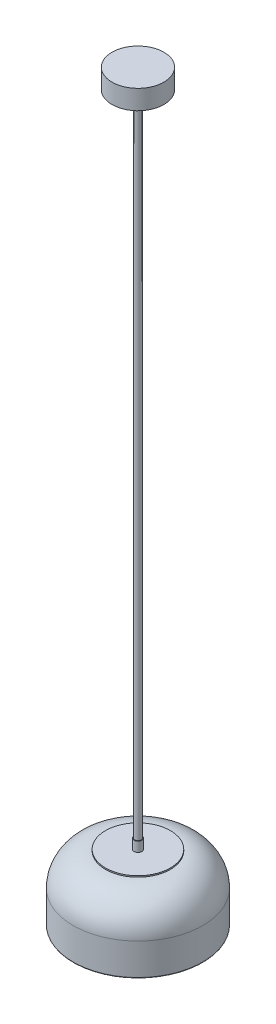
ISO-10303-21;
HEADER;
FILE_DESCRIPTION(('STEP AP214'),'2;1');
FILE_NAME('part.step','',(''),(''),'','','');
FILE_SCHEMA(('AUTOMOTIVE_DESIGN { 1 0 10303 214 1 1 1 1 }'));
ENDSEC;
DATA;
#1=APPLICATION_CONTEXT('core data for automotive mechanical design processes');
#2=APPLICATION_PROTOCOL_DEFINITION('international standard','automotive_design',2000,#1);
#3=PRODUCT_CONTEXT('',#1,'mechanical');
#4=PRODUCT('Part','Part','',(#3));
#5=PRODUCT_RELATED_PRODUCT_CATEGORY('part','',(#4));
#6=PRODUCT_DEFINITION_FORMATION('','',#4);
#7=PRODUCT_DEFINITION_CONTEXT('part definition',#1,'design');
#8=PRODUCT_DEFINITION('design','',#6,#7);
#9=PRODUCT_DEFINITION_SHAPE('','',#8);
#10=(LENGTH_UNIT() NAMED_UNIT(*) SI_UNIT(.MILLI.,.METRE.));
#11=(NAMED_UNIT(*) PLANE_ANGLE_UNIT() SI_UNIT($,.RADIAN.));
#12=(NAMED_UNIT(*) SI_UNIT($,.STERADIAN.) SOLID_ANGLE_UNIT());
#13=UNCERTAINTY_MEASURE_WITH_UNIT(LENGTH_MEASURE(1.E-05),#10,'distance_accuracy_value','');
#14=(GEOMETRIC_REPRESENTATION_CONTEXT(3) GLOBAL_UNCERTAINTY_ASSIGNED_CONTEXT((#13)) GLOBAL_UNIT_ASSIGNED_CONTEXT((#10,
#11,#12)) REPRESENTATION_CONTEXT('',''));
#15=CARTESIAN_POINT('',(0.,0.,0.));
#16=DIRECTION('',(0.,0.,1.));
#17=DIRECTION('',(1.,0.,0.));
#18=AXIS2_PLACEMENT_3D('',#15,#16,#17);
#19=CARTESIAN_POINT('',(0.,32.,0.));
#20=DIRECTION('',(0.,-1.,0.));
#21=DIRECTION('',(0.,0.,-1.));
#22=AXIS2_PLACEMENT_3D('',#19,#20,#21);
#23=CYLINDRICAL_SURFACE('',#22,50.);
#24=CARTESIAN_POINT('',(0.,32.,0.));
#25=DIRECTION('',(0.,1.,0.));
#26=DIRECTION('',(0.,0.,1.));
#27=AXIS2_PLACEMENT_3D('',#24,#25,#26);
#28=CIRCLE('',#27,50.);
#29=CARTESIAN_POINT('',(0.,32.,50.));
#30=VERTEX_POINT('',#29);
#31=EDGE_CURVE('E47',#30,#30,#28,.T.);
#32=ORIENTED_EDGE('',*,*,#31,.F.);
#33=EDGE_LOOP('',(#32));
#34=FACE_BOUND('',#33,.T.);
#35=CARTESIAN_POINT('',(0.,30.,0.));
#36=DIRECTION('',(0.,1.,0.));
#37=DIRECTION('',(0.,0.,1.));
#38=AXIS2_PLACEMENT_3D('',#35,#36,#37);
#39=CIRCLE('',#38,50.);
#40=CARTESIAN_POINT('',(0.,30.,50.));
#41=VERTEX_POINT('',#40);
#42=EDGE_CURVE('E43',#41,#41,#39,.T.);
#43=ORIENTED_EDGE('',*,*,#42,.T.);
#44=EDGE_LOOP('',(#43));
#45=FACE_BOUND('',#44,.T.);
#46=ADVANCED_FACE('F40',(#34,#45),#23,.T.);
#47=CARTESIAN_POINT('',(0.,32.,0.));
#48=DIRECTION('',(0.,1.,0.));
#49=DIRECTION('',(0.,0.,1.));
#50=AXIS2_PLACEMENT_3D('',#47,#48,#49);
#51=PLANE('',#50);
#52=CARTESIAN_POINT('',(0.,32.,0.));
#53=DIRECTION('',(0.,1.,0.));
#54=DIRECTION('',(0.,0.,1.));
#55=AXIS2_PLACEMENT_3D('',#52,#53,#54);
#56=CIRCLE('',#55,6.);
#57=CARTESIAN_POINT('',(0.,32.,6.));
#58=VERTEX_POINT('',#57);
#59=EDGE_CURVE('E59',#58,#58,#56,.T.);
#60=ORIENTED_EDGE('',*,*,#59,.F.);
#61=EDGE_LOOP('',(#60));
#62=FACE_BOUND('',#61,.T.);
#63=ORIENTED_EDGE('',*,*,#31,.T.);
#64=EDGE_LOOP('',(#63));
#65=FACE_BOUND('',#64,.T.);
#66=ADVANCED_FACE('F87',(#62,#65),#51,.T.);
#67=CARTESIAN_POINT('',(0.,30.,0.));
#68=DIRECTION('',(0.,1.,0.));
#69=DIRECTION('',(0.,0.,1.));
#70=AXIS2_PLACEMENT_3D('',#67,#68,#69);
#71=PLANE('',#70);
#72=ORIENTED_EDGE('',*,*,#42,.F.);
#73=EDGE_LOOP('',(#72));
#74=FACE_BOUND('',#73,.T.);
#75=ADVANCED_FACE('F92',(#74),#71,.F.);
#76=CARTESIAN_POINT('',(0.,47.,0.));
#77=DIRECTION('',(0.,-1.,0.));
#78=DIRECTION('',(0.,0.,-1.));
#79=AXIS2_PLACEMENT_3D('',#76,#77,#78);
#80=CYLINDRICAL_SURFACE('',#79,6.);
#81=CARTESIAN_POINT('',(0.,47.,0.));
#82=DIRECTION('',(0.,1.,0.));
#83=DIRECTION('',(0.,0.,1.));
#84=AXIS2_PLACEMENT_3D('',#81,#82,#83);
#85=CIRCLE('',#84,6.);
#86=CARTESIAN_POINT('',(0.,47.,6.));
#87=VERTEX_POINT('',#86);
#88=EDGE_CURVE('E56',#87,#87,#85,.T.);
#89=ORIENTED_EDGE('',*,*,#88,.F.);
#90=EDGE_LOOP('',(#89));
#91=FACE_BOUND('',#90,.T.);
#92=ORIENTED_EDGE('',*,*,#59,.T.);
#93=EDGE_LOOP('',(#92));
#94=FACE_BOUND('',#93,.T.);
#95=ADVANCED_FACE('F101',(#91,#94),#80,.T.);
#96=CARTESIAN_POINT('',(0.,47.,0.));
#97=DIRECTION('',(0.,1.,0.));
#98=DIRECTION('',(0.,0.,1.));
#99=AXIS2_PLACEMENT_3D('',#96,#97,#98);
#100=PLANE('',#99);
#101=CARTESIAN_POINT('',(0.,47.,0.));
#102=DIRECTION('',(0.,1.,0.));
#103=DIRECTION('',(0.,0.,1.));
#104=AXIS2_PLACEMENT_3D('',#101,#102,#103);
#105=CIRCLE('',#104,5.);
#106=CARTESIAN_POINT('',(0.,47.,5.));
#107=VERTEX_POINT('',#106);
#108=EDGE_CURVE('E11',#107,#107,#105,.T.);
#109=ORIENTED_EDGE('',*,*,#108,.F.);
#110=EDGE_LOOP('',(#109));
#111=FACE_BOUND('',#110,.T.);
#112=ORIENTED_EDGE('',*,*,#88,.T.);
#113=EDGE_LOOP('',(#112));
#114=FACE_BOUND('',#113,.T.);
#115=ADVANCED_FACE('F105',(#111,#114),#100,.T.);
#116=CARTESIAN_POINT('',(0.,1047.,0.));
#117=DIRECTION('',(0.,-1.,0.));
#118=DIRECTION('',(0.,0.,-1.));
#119=AXIS2_PLACEMENT_3D('',#116,#117,#118);
#120=CYLINDRICAL_SURFACE('',#119,5.);
#121=CARTESIAN_POINT('',(0.,1047.,0.));
#122=DIRECTION('',(0.,1.,0.));
#123=DIRECTION('',(0.,0.,1.));
#124=AXIS2_PLACEMENT_3D('',#121,#122,#123);
#125=CIRCLE('',#124,5.);
#126=CARTESIAN_POINT('',(0.,1047.,5.));
#127=VERTEX_POINT('',#126);
#128=EDGE_CURVE('E54',#127,#127,#125,.T.);
#129=ORIENTED_EDGE('',*,*,#128,.F.);
#130=EDGE_LOOP('',(#129));
#131=FACE_BOUND('',#130,.T.);
#132=ORIENTED_EDGE('',*,*,#108,.T.);
#133=EDGE_LOOP('',(#132));
#134=FACE_BOUND('',#133,.T.);
#135=ADVANCED_FACE('F111',(#131,#134),#120,.T.);
#136=CARTESIAN_POINT('',(0.,1077.,0.));
#137=DIRECTION('',(0.,-1.,0.));
#138=DIRECTION('',(0.,0.,-1.));
#139=AXIS2_PLACEMENT_3D('',#136,#137,#138);
#140=CYLINDRICAL_SURFACE('',#139,40.);
#141=CARTESIAN_POINT('',(0.,1077.,0.));
#142=DIRECTION('',(0.,1.,0.));
#143=DIRECTION('',(0.,0.,1.));
#144=AXIS2_PLACEMENT_3D('',#141,#142,#143);
#145=CIRCLE('',#144,40.);
#146=CARTESIAN_POINT('',(0.,1077.,40.));
#147=VERTEX_POINT('',#146);
#148=EDGE_CURVE('E64',#147,#147,#145,.T.);
#149=ORIENTED_EDGE('',*,*,#148,.F.);
#150=EDGE_LOOP('',(#149));
#151=FACE_BOUND('',#150,.T.);
#152=CARTESIAN_POINT('',(0.,1047.,0.));
#153=DIRECTION('',(0.,1.,0.));
#154=DIRECTION('',(0.,0.,1.));
#155=AXIS2_PLACEMENT_3D('',#152,#153,#154);
#156=CIRCLE('',#155,40.);
#157=CARTESIAN_POINT('',(0.,1047.,40.));
#158=VERTEX_POINT('',#157);
#159=EDGE_CURVE('E68',#158,#158,#156,.T.);
#160=ORIENTED_EDGE('',*,*,#159,.T.);
#161=EDGE_LOOP('',(#160));
#162=FACE_BOUND('',#161,.T.);
#163=ADVANCED_FACE('F75',(#151,#162),#140,.T.);
#164=CARTESIAN_POINT('',(0.,1077.,0.));
#165=DIRECTION('',(0.,1.,0.));
#166=DIRECTION('',(0.,0.,1.));
#167=AXIS2_PLACEMENT_3D('',#164,#165,#166);
#168=PLANE('',#167);
#169=ORIENTED_EDGE('',*,*,#148,.T.);
#170=EDGE_LOOP('',(#169));
#171=FACE_BOUND('',#170,.T.);
#172=ADVANCED_FACE('F79',(#171),#168,.T.);
#173=CARTESIAN_POINT('',(0.,1047.,0.));
#174=DIRECTION('',(0.,1.,0.));
#175=DIRECTION('',(0.,0.,1.));
#176=AXIS2_PLACEMENT_3D('',#173,#174,#175);
#177=PLANE('',#176);
#178=ORIENTED_EDGE('',*,*,#128,.T.);
#179=EDGE_LOOP('',(#178));
#180=FACE_BOUND('',#179,.T.);
#181=ORIENTED_EDGE('',*,*,#159,.F.);
#182=EDGE_LOOP('',(#181));
#183=FACE_BOUND('',#182,.T.);
#184=ADVANCED_FACE('F77',(#180,#183),#177,.F.);
#185=CLOSED_SHELL('',(#46,#66,#75,#95,#115,#135,#163,#172,#184));
#186=MANIFOLD_SOLID_BREP('B2',#185);
#187=CARTESIAN_POINT('',(0.,-10.,0.));
#188=DIRECTION('',(0.,1.,0.));
#189=DIRECTION('',(0.,0.,1.));
#190=AXIS2_PLACEMENT_3D('',#187,#188,#189);
#191=CYLINDRICAL_SURFACE('',#190,50.);
#192=CARTESIAN_POINT('',(0.,0.,0.));
#193=DIRECTION('',(0.,-1.,0.));
#194=DIRECTION('',(0.,0.,-1.));
#195=AXIS2_PLACEMENT_3D('',#192,#193,#194);
#196=CIRCLE('',#195,50.);
#197=CARTESIAN_POINT('',(0.,0.,-50.));
#198=VERTEX_POINT('',#197);
#199=EDGE_CURVE('E39',#198,#198,#196,.F.);
#200=ORIENTED_EDGE('',*,*,#199,.T.);
#201=EDGE_LOOP('',(#200));
#202=FACE_BOUND('',#201,.T.);
#203=CARTESIAN_POINT('',(0.,5.,0.));
#204=DIRECTION('',(0.,-1.,0.));
#205=DIRECTION('',(0.,0.,-1.));
#206=AXIS2_PLACEMENT_3D('',#203,#204,#205);
#207=CIRCLE('',#206,50.);
#208=CARTESIAN_POINT('',(0.,5.,-50.));
#209=VERTEX_POINT('',#208);
#210=EDGE_CURVE('E189',#209,#209,#207,.T.);
#211=ORIENTED_EDGE('',*,*,#210,.T.);
#212=EDGE_LOOP('',(#211));
#213=FACE_BOUND('',#212,.T.);
#214=ADVANCED_FACE('F178',(#202,#213),#191,.T.);
#215=CARTESIAN_POINT('',(0.,-10.,0.));
#216=DIRECTION('',(0.,-1.,0.));
#217=DIRECTION('',(0.,0.,-1.));
#218=AXIS2_PLACEMENT_3D('',#215,#216,#217);
#219=PLANE('',#218);
#220=CARTESIAN_POINT('',(0.,-10.,0.));
#221=DIRECTION('',(0.,-1.,0.));
#222=DIRECTION('',(0.,0.,-1.));
#223=AXIS2_PLACEMENT_3D('',#220,#221,#222);
#224=CIRCLE('',#223,40.);
#225=CARTESIAN_POINT('',(0.,-10.,-40.));
#226=VERTEX_POINT('',#225);
#227=EDGE_CURVE('E185',#226,#226,#224,.T.);
#228=ORIENTED_EDGE('',*,*,#227,.T.);
#229=EDGE_LOOP('',(#228));
#230=FACE_BOUND('',#229,.T.);
#231=ADVANCED_FACE('F199',(#230),#219,.T.);
#232=CARTESIAN_POINT('',(0.,5.,0.));
#233=DIRECTION('',(0.,-1.,0.));
#234=DIRECTION('',(0.,0.,-1.));
#235=AXIS2_PLACEMENT_3D('',#232,#233,#234);
#236=PLANE('',#235);
#237=ORIENTED_EDGE('',*,*,#210,.F.);
#238=EDGE_LOOP('',(#237));
#239=FACE_BOUND('',#238,.T.);
#240=ADVANCED_FACE('F197',(#239),#236,.F.);
#241=CARTESIAN_POINT('',(0.,0.,0.));
#242=DIRECTION('',(0.,-1.,0.));
#243=DIRECTION('',(0.,0.,-1.));
#244=AXIS2_PLACEMENT_3D('',#241,#242,#243);
#245=TOROIDAL_SURFACE('',#244,40.,10.);
#246=ORIENTED_EDGE('',*,*,#199,.F.);
#247=EDGE_LOOP('',(#246));
#248=FACE_BOUND('',#247,.T.);
#249=ORIENTED_EDGE('',*,*,#227,.F.);
#250=EDGE_LOOP('',(#249));
#251=FACE_BOUND('',#250,.T.);
#252=ADVANCED_FACE('F180',(#248,#251),#245,.T.);
#253=CLOSED_SHELL('',(#214,#231,#240,#252));
#254=MANIFOLD_SOLID_BREP('B6',#253);
#255=CARTESIAN_POINT('',(0.,5.,0.));
#256=DIRECTION('',(0.,1.,0.));
#257=DIRECTION('',(0.,0.,1.));
#258=AXIS2_PLACEMENT_3D('',#255,#256,#257);
#259=CYLINDRICAL_SURFACE('',#258,50.);
#260=CARTESIAN_POINT('',(0.,5.,0.));
#261=DIRECTION('',(0.,-1.,0.));
#262=DIRECTION('',(0.,0.,-1.));
#263=AXIS2_PLACEMENT_3D('',#260,#261,#262);
#264=CIRCLE('',#263,50.);
#265=CARTESIAN_POINT('',(0.,5.,-50.));
#266=VERTEX_POINT('',#265);
#267=EDGE_CURVE('E177',#266,#266,#264,.T.);
#268=ORIENTED_EDGE('',*,*,#267,.F.);
#269=EDGE_LOOP('',(#268));
#270=FACE_BOUND('',#269,.T.);
#271=CARTESIAN_POINT('',(0.,25.,0.));
#272=DIRECTION('',(0.,-1.,0.));
#273=DIRECTION('',(0.,0.,-1.));
#274=AXIS2_PLACEMENT_3D('',#271,#272,#273);
#275=CIRCLE('',#274,50.);
#276=CARTESIAN_POINT('',(0.,25.,-50.));
#277=VERTEX_POINT('',#276);
#278=EDGE_CURVE('E244',#277,#277,#275,.T.);
#279=ORIENTED_EDGE('',*,*,#278,.T.);
#280=EDGE_LOOP('',(#279));
#281=FACE_BOUND('',#280,.T.);
#282=ADVANCED_FACE('F241',(#270,#281),#259,.T.);
#283=CARTESIAN_POINT('',(0.,5.,0.));
#284=DIRECTION('',(0.,-1.,0.));
#285=DIRECTION('',(0.,0.,-1.));
#286=AXIS2_PLACEMENT_3D('',#283,#284,#285);
#287=PLANE('',#286);
#288=ORIENTED_EDGE('',*,*,#267,.T.);
#289=EDGE_LOOP('',(#288));
#290=FACE_BOUND('',#289,.T.);
#291=ADVANCED_FACE('F256',(#290),#287,.T.);
#292=CARTESIAN_POINT('',(0.,25.,0.));
#293=DIRECTION('',(0.,-1.,0.));
#294=DIRECTION('',(0.,0.,-1.));
#295=AXIS2_PLACEMENT_3D('',#292,#293,#294);
#296=PLANE('',#295);
#297=ORIENTED_EDGE('',*,*,#278,.F.);
#298=EDGE_LOOP('',(#297));
#299=FACE_BOUND('',#298,.T.);
#300=ADVANCED_FACE('F254',(#299),#296,.F.);
#301=CLOSED_SHELL('',(#282,#291,#300));
#302=MANIFOLD_SOLID_BREP('B34',#301);
#303=CARTESIAN_POINT('',(0.,25.,0.));
#304=DIRECTION('',(0.,1.,0.));
#305=DIRECTION('',(0.,0.,1.));
#306=AXIS2_PLACEMENT_3D('',#303,#304,#305);
#307=CYLINDRICAL_SURFACE('',#306,50.);
#308=CARTESIAN_POINT('',(0.,25.,0.));
#309=DIRECTION('',(0.,-1.,0.));
#310=DIRECTION('',(0.,0.,-1.));
#311=AXIS2_PLACEMENT_3D('',#308,#309,#310);
#312=CIRCLE('',#311,50.);
#313=CARTESIAN_POINT('',(0.,25.,-50.));
#314=VERTEX_POINT('',#313);
#315=EDGE_CURVE('E240',#314,#314,#312,.T.);
#316=ORIENTED_EDGE('',*,*,#315,.F.);
#317=EDGE_LOOP('',(#316));
#318=FACE_BOUND('',#317,.T.);
#319=CARTESIAN_POINT('',(0.,27.,0.));
#320=DIRECTION('',(0.,-1.,0.));
#321=DIRECTION('',(0.,0.,-1.));
#322=AXIS2_PLACEMENT_3D('',#319,#320,#321);
#323=CIRCLE('',#322,50.);
#324=CARTESIAN_POINT('',(0.,27.,-50.));
#325=VERTEX_POINT('',#324);
#326=EDGE_CURVE('E291',#325,#325,#323,.T.);
#327=ORIENTED_EDGE('',*,*,#326,.T.);
#328=EDGE_LOOP('',(#327));
#329=FACE_BOUND('',#328,.T.);
#330=ADVANCED_FACE('F288',(#318,#329),#307,.T.);
#331=CARTESIAN_POINT('',(0.,25.,0.));
#332=DIRECTION('',(0.,-1.,0.));
#333=DIRECTION('',(0.,0.,-1.));
#334=AXIS2_PLACEMENT_3D('',#331,#332,#333);
#335=PLANE('',#334);
#336=ORIENTED_EDGE('',*,*,#315,.T.);
#337=EDGE_LOOP('',(#336));
#338=FACE_BOUND('',#337,.T.);
#339=ADVANCED_FACE('F303',(#338),#335,.T.);
#340=CARTESIAN_POINT('',(0.,27.,0.));
#341=DIRECTION('',(0.,-1.,0.));
#342=DIRECTION('',(0.,0.,-1.));
#343=AXIS2_PLACEMENT_3D('',#340,#341,#342);
#344=PLANE('',#343);
#345=ORIENTED_EDGE('',*,*,#326,.F.);
#346=EDGE_LOOP('',(#345));
#347=FACE_BOUND('',#346,.T.);
#348=ADVANCED_FACE('F301',(#347),#344,.F.);
#349=CLOSED_SHELL('',(#330,#339,#348));
#350=MANIFOLD_SOLID_BREP('B172',#349);
#351=CARTESIAN_POINT('',(50.,30.,0.));
#352=DIRECTION('',(0.,-1.,0.));
#353=DIRECTION('',(1.,0.,0.));
#354=AXIS2_PLACEMENT_3D('',#351,#352,#353);
#355=PLANE('',#354);
#356=CARTESIAN_POINT('',(0.,30.,0.));
#357=DIRECTION('',(0.,1.,0.));
#358=DIRECTION('',(-1.,0.,0.));
#359=AXIS2_PLACEMENT_3D('',#356,#357,#358);
#360=CIRCLE('',#359,50.);
#361=CARTESIAN_POINT('',(-50.,30.,0.));
#362=VERTEX_POINT('',#361);
#363=EDGE_CURVE('E340',#362,#362,#360,.T.);
#364=ORIENTED_EDGE('',*,*,#363,.T.);
#365=EDGE_LOOP('',(#364));
#366=FACE_BOUND('',#365,.T.);
#367=ADVANCED_FACE('F328',(#366),#355,.F.);
#368=CARTESIAN_POINT('',(0.,-20.,0.));
#369=DIRECTION('',(0.,1.,0.));
#370=DIRECTION('',(-1.,0.,0.));
#371=AXIS2_PLACEMENT_3D('',#368,#369,#370);
#372=DEGENERATE_TOROIDAL_SURFACE('',#371,50.,50.,.T.);
#373=ORIENTED_EDGE('',*,*,#363,.F.);
#374=EDGE_LOOP('',(#373));
#375=FACE_BOUND('',#374,.T.);
#376=CARTESIAN_POINT('',(0.,-20.,0.));
#377=DIRECTION('',(0.,1.,0.));
#378=DIRECTION('',(-1.,0.,0.));
#379=AXIS2_PLACEMENT_3D('',#376,#377,#378);
#380=CIRCLE('',#379,100.);
#381=CARTESIAN_POINT('',(-100.,-20.,0.));
#382=VERTEX_POINT('',#381);
#383=EDGE_CURVE('E345',#382,#382,#380,.T.);
#384=ORIENTED_EDGE('',*,*,#383,.T.);
#385=EDGE_LOOP('',(#384));
#386=FACE_BOUND('',#385,.T.);
#387=ADVANCED_FACE('F368',(#375,#386),#372,.T.);
#388=CARTESIAN_POINT('',(0.,30.,0.));
#389=DIRECTION('',(0.,1.,0.));
#390=DIRECTION('',(-1.,0.,0.));
#391=AXIS2_PLACEMENT_3D('',#388,#389,#390);
#392=CYLINDRICAL_SURFACE('',#391,100.);
#393=CARTESIAN_POINT('',(0.,-68.5,0.));
#394=DIRECTION('',(0.,1.,0.));
#395=DIRECTION('',(-1.,0.,0.));
#396=AXIS2_PLACEMENT_3D('',#393,#394,#395);
#397=CIRCLE('',#396,100.);
#398=CARTESIAN_POINT('',(-100.,-68.5,0.));
#399=VERTEX_POINT('',#398);
#400=EDGE_CURVE('E336',#399,#399,#397,.T.);
#401=ORIENTED_EDGE('',*,*,#400,.T.);
#402=EDGE_LOOP('',(#401));
#403=FACE_BOUND('',#402,.T.);
#404=ORIENTED_EDGE('',*,*,#383,.F.);
#405=EDGE_LOOP('',(#404));
#406=FACE_BOUND('',#405,.T.);
#407=ADVANCED_FACE('F360',(#403,#406),#392,.T.);
#408=CARTESIAN_POINT('',(50.,27.,0.));
#409=DIRECTION('',(0.,-1.,0.));
#410=DIRECTION('',(1.,0.,0.));
#411=AXIS2_PLACEMENT_3D('',#408,#409,#410);
#412=PLANE('',#411);
#413=CARTESIAN_POINT('',(0.,27.,0.));
#414=DIRECTION('',(0.,1.,0.));
#415=DIRECTION('',(-1.,0.,0.));
#416=AXIS2_PLACEMENT_3D('',#413,#414,#415);
#417=CIRCLE('',#416,50.);
#418=CARTESIAN_POINT('',(-50.,27.,0.));
#419=VERTEX_POINT('',#418);
#420=EDGE_CURVE('E348',#419,#419,#417,.T.);
#421=ORIENTED_EDGE('',*,*,#420,.F.);
#422=EDGE_LOOP('',(#421));
#423=FACE_BOUND('',#422,.T.);
#424=ADVANCED_FACE('F358',(#423),#412,.T.);
#425=CARTESIAN_POINT('',(0.,-20.,0.));
#426=DIRECTION('',(0.,1.,0.));
#427=DIRECTION('',(-1.,0.,0.));
#428=AXIS2_PLACEMENT_3D('',#425,#426,#427);
#429=TOROIDAL_SURFACE('',#428,50.,47.);
#430=ORIENTED_EDGE('',*,*,#420,.T.);
#431=EDGE_LOOP('',(#430));
#432=FACE_BOUND('',#431,.T.);
#433=CARTESIAN_POINT('',(0.,-20.,0.));
#434=DIRECTION('',(0.,1.,0.));
#435=DIRECTION('',(-1.,0.,0.));
#436=AXIS2_PLACEMENT_3D('',#433,#434,#435);
#437=CIRCLE('',#436,97.);
#438=CARTESIAN_POINT('',(-97.,-20.,0.));
#439=VERTEX_POINT('',#438);
#440=EDGE_CURVE('E349',#439,#439,#437,.T.);
#441=ORIENTED_EDGE('',*,*,#440,.F.);
#442=EDGE_LOOP('',(#441));
#443=FACE_BOUND('',#442,.T.);
#444=ADVANCED_FACE('F355',(#432,#443),#429,.F.);
#445=CARTESIAN_POINT('',(0.,30.,0.));
#446=DIRECTION('',(0.,1.,0.));
#447=DIRECTION('',(-1.,0.,0.));
#448=AXIS2_PLACEMENT_3D('',#445,#446,#447);
#449=CYLINDRICAL_SURFACE('',#448,97.);
#450=CARTESIAN_POINT('',(0.,-68.5,0.));
#451=DIRECTION('',(0.,1.,0.));
#452=DIRECTION('',(-1.,0.,0.));
#453=AXIS2_PLACEMENT_3D('',#450,#451,#452);
#454=CIRCLE('',#453,97.);
#455=CARTESIAN_POINT('',(-97.,-68.5,0.));
#456=VERTEX_POINT('',#455);
#457=EDGE_CURVE('E287',#456,#456,#454,.F.);
#458=ORIENTED_EDGE('',*,*,#457,.T.);
#459=EDGE_LOOP('',(#458));
#460=FACE_BOUND('',#459,.T.);
#461=ORIENTED_EDGE('',*,*,#440,.T.);
#462=EDGE_LOOP('',(#461));
#463=FACE_BOUND('',#462,.T.);
#464=ADVANCED_FACE('F366',(#460,#463),#449,.F.);
#465=CARTESIAN_POINT('',(0.,-68.5,0.));
#466=DIRECTION('',(0.,1.,0.));
#467=DIRECTION('',(-1.,0.,0.));
#468=AXIS2_PLACEMENT_3D('',#465,#466,#467);
#469=TOROIDAL_SURFACE('',#468,98.5,1.5);
#470=ORIENTED_EDGE('',*,*,#457,.F.);
#471=EDGE_LOOP('',(#470));
#472=FACE_BOUND('',#471,.T.);
#473=CARTESIAN_POINT('',(0.,-70.,0.));
#474=DIRECTION('',(0.,1.,0.));
#475=DIRECTION('',(-1.,0.,0.));
#476=AXIS2_PLACEMENT_3D('',#473,#474,#475);
#477=CIRCLE('',#476,98.5);
#478=CARTESIAN_POINT('',(-98.5,-70.,0.));
#479=VERTEX_POINT('',#478);
#480=EDGE_CURVE('E332',#479,#479,#477,.T.);
#481=ORIENTED_EDGE('',*,*,#480,.F.);
#482=EDGE_LOOP('',(#481));
#483=FACE_BOUND('',#482,.T.);
#484=ADVANCED_FACE('F330',(#472,#483),#469,.T.);
#485=CARTESIAN_POINT('',(0.,-68.5,0.));
#486=DIRECTION('',(0.,1.,0.));
#487=DIRECTION('',(-1.,0.,0.));
#488=AXIS2_PLACEMENT_3D('',#485,#486,#487);
#489=TOROIDAL_SURFACE('',#488,98.5,1.5);
#490=ORIENTED_EDGE('',*,*,#480,.T.);
#491=EDGE_LOOP('',(#490));
#492=FACE_BOUND('',#491,.T.);
#493=ORIENTED_EDGE('',*,*,#400,.F.);
#494=EDGE_LOOP('',(#493));
#495=FACE_BOUND('',#494,.T.);
#496=ADVANCED_FACE('F379',(#492,#495),#489,.T.);
#497=CLOSED_SHELL('',(#367,#387,#407,#424,#444,#464,#484,#496));
#498=MANIFOLD_SOLID_BREP('B235',#497);
#499=ADVANCED_BREP_SHAPE_REPRESENTATION('',(#18,#186,#254,#302,#350,#498),#14);
#500=SHAPE_DEFINITION_REPRESENTATION(#9,#499);
ENDSEC;
END-ISO-10303-21;
